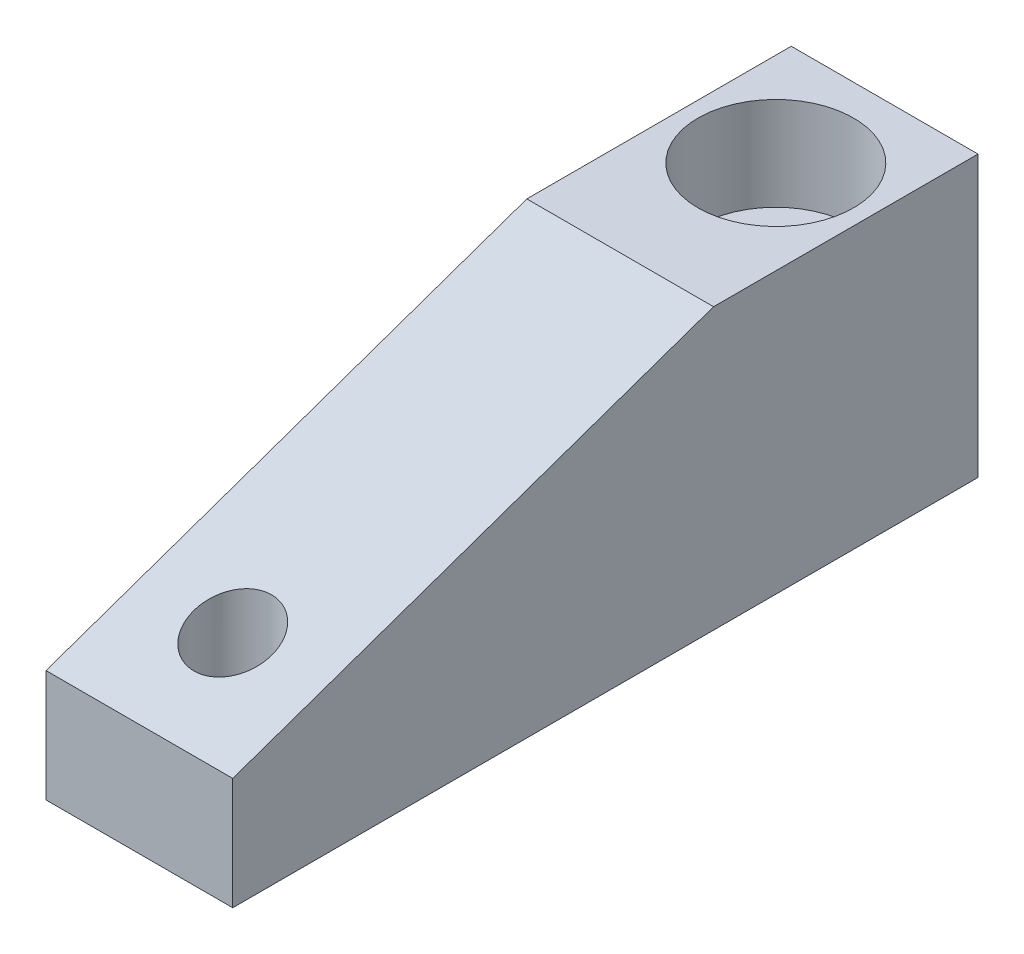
from build123d import *

# Parameters (mm, degrees)
SKETCH1_W          = 19.05
SKETCH1_H          = 76.0222
EXTRUDE1_DEPTH     = 28.575
FILLET1_R          = 0.381
CUT_EXTRUDE1_DEPTH = 84.419470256
SKETCH5_R          = 3.9624
CUT_EXTRUDE2_DEPTH = 84.419470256


with BuildPart() as part:
    # Sketch1 → Extrude1 (new body)
    with BuildSketch(Plane(origin=(0, 0, 0), x_dir=(1, 0, 0), z_dir=(0, 1, 0))):
        with Locations((9.525, -38.0111)):
            Rectangle(SKETCH1_W, SKETCH1_H)
    extrude(amount=EXTRUDE1_DEPTH)

    # Sketch3 → Cut-Revolve1 (revolve, cut)
    with BuildSketch(Plane(origin=(9.525, 0, 0), x_dir=(0, 0, -1), z_dir=(1, 0, 0))):
        Polygon((-19.0373, 28.575), (-19.0373, 19.05), (-16.0528, 19.05), (-16.0528, 13.1064), (-18.600014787, 13.1064), (-19.0119, 0), (-11.0998, 0), (-11.0998, 28.575), align=None)
    revolve(axis=Axis((9.525, 31.679444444, 11.0998), (0, -1, 0)), mode=Mode.SUBTRACT)

    # Fillet1
    fillet1_edges = [part.edges().sort_by_distance(p)[0] for p in [
        (9.525, 13.1064, 3.599585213),
    ]]
    fillet(fillet1_edges, radius=FILLET1_R)

    # Sketch4 → Cut-Extrude1 (cut, through all)
    with BuildSketch(Plane(origin=(19.05, 0, 0), x_dir=(0, 0, -1), z_dir=(1, 0, 0))):
        Polygon((-76.0222, 11.43), (-76.0222, 28.575), (-26.9748, 28.575), align=None)
    extrude(amount=-CUT_EXTRUDE1_DEPTH, mode=Mode.SUBTRACT)

    # Sketch5 → Cut-Extrude2 (cut, through all)
    with BuildSketch(Plane.XZ):
        with Locations(Location((9.525, 66.4972, 0), (0, 0, 270))):
            Circle(SKETCH5_R)
    extrude(amount=-CUT_EXTRUDE2_DEPTH, mode=Mode.SUBTRACT)


solid = part.part
